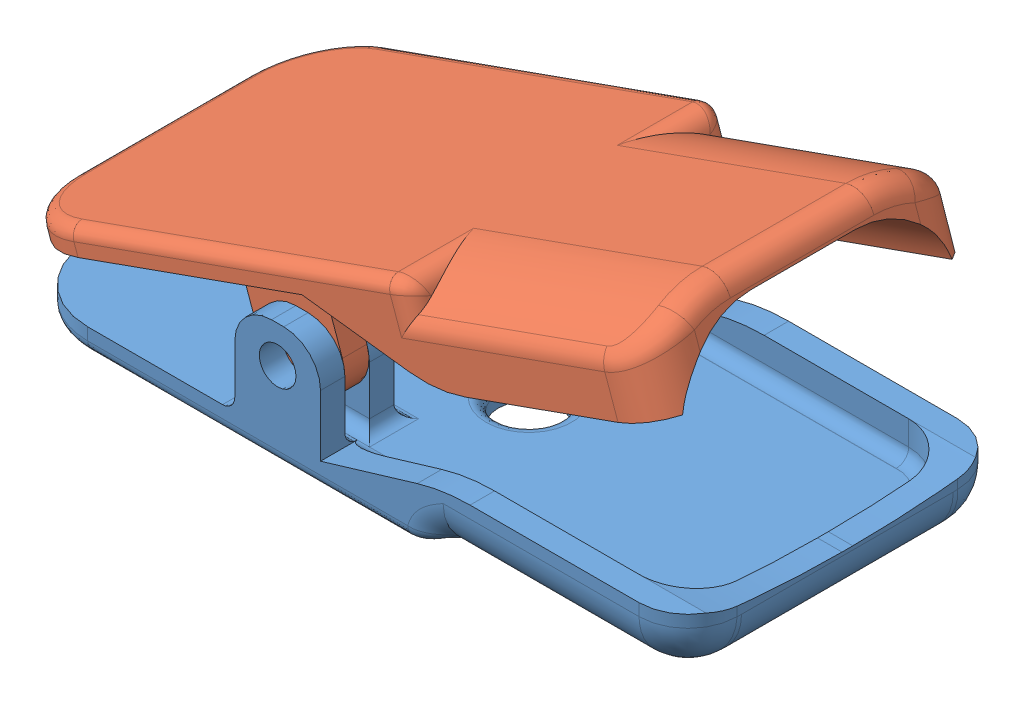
SolidWorks assembly finger_clip.SLDASM, configuration Default (file format 13000). Lengths in mm.
Overall size (56.1 27.86 26.29).
2 component instances, 2 part files, 3 mates.
Components (placement in the parent):
- finger clip down-1: finger clip down.SLDPRT [Default] at (24.3895 22.4613 44.4205) size (55 10.27 26.29)
- finger clip up-1: finger clip up.SLDPRT [Default] at (21.6955 38.0677 44.4305) x (0.942129 0.335252 0) z (0 0 -1) size (55 10 26)
Mates (geometry in assembly coordinates):
- Parallel1: parallel anti-aligned: plane of finger clip down-1 through (21.8895 32.4613 33.461) normal (0 0 1); plane of finger clip up-1 through (16.0978 25.4616 33.4305) normal (0 0 -1)
- Concentric1: concentric anti-aligned: circle of finger clip down-1; circle of finger clip up-1
- Coincident4: coincident anti-aligned: plane of finger clip down-1 through (21.8895 32.4613 55.4305) normal (0 0 -1); plane of finger clip up-1 through (16.0978 25.4616 55.4305) normal (0 0 1)
